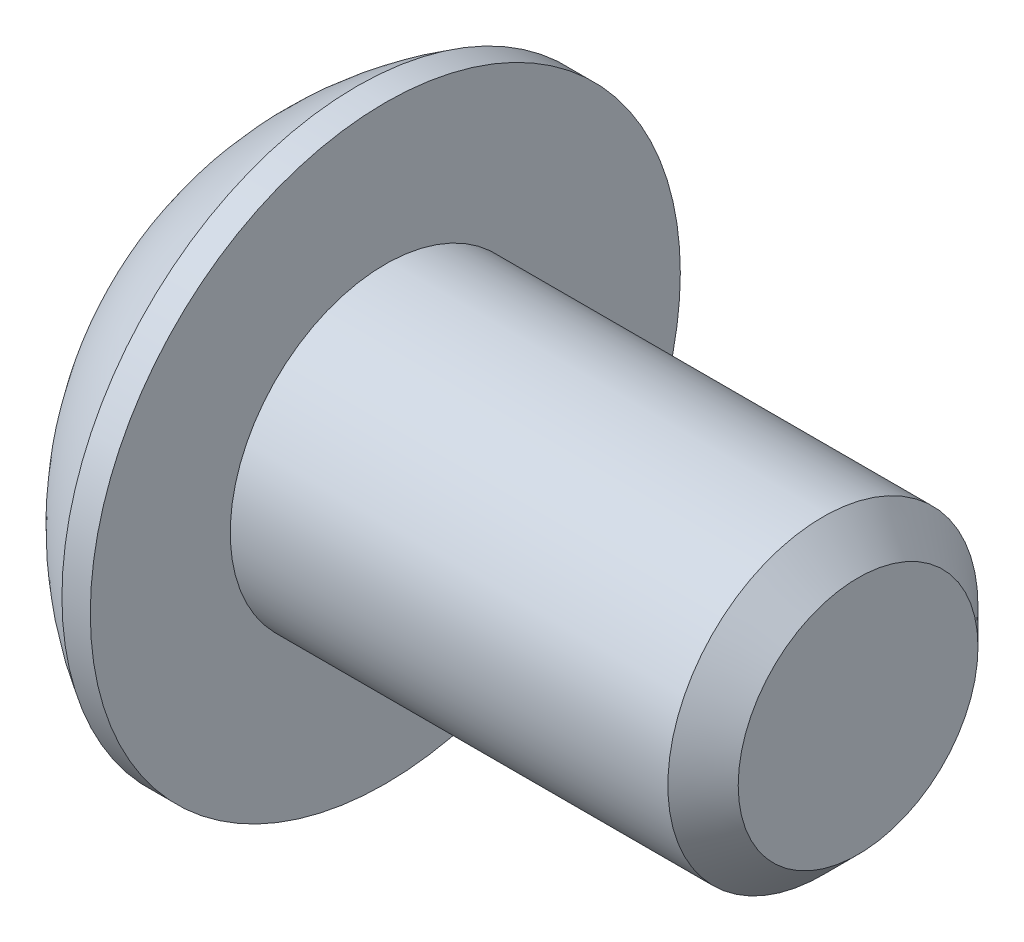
ISO-10303-21;
HEADER;
FILE_DESCRIPTION(('STEP AP214'),'2;1');
FILE_NAME('part.step','',(''),(''),'','','');
FILE_SCHEMA(('AUTOMOTIVE_DESIGN { 1 0 10303 214 1 1 1 1 }'));
ENDSEC;
DATA;
#1=APPLICATION_CONTEXT('core data for automotive mechanical design processes');
#2=APPLICATION_PROTOCOL_DEFINITION('international standard','automotive_design',2000,#1);
#3=PRODUCT_CONTEXT('',#1,'mechanical');
#4=PRODUCT('Part','Part','',(#3));
#5=PRODUCT_RELATED_PRODUCT_CATEGORY('part','',(#4));
#6=PRODUCT_DEFINITION_FORMATION('','',#4);
#7=PRODUCT_DEFINITION_CONTEXT('part definition',#1,'design');
#8=PRODUCT_DEFINITION('design','',#6,#7);
#9=PRODUCT_DEFINITION_SHAPE('','',#8);
#10=(LENGTH_UNIT() NAMED_UNIT(*) SI_UNIT(.MILLI.,.METRE.));
#11=(NAMED_UNIT(*) PLANE_ANGLE_UNIT() SI_UNIT($,.RADIAN.));
#12=(NAMED_UNIT(*) SI_UNIT($,.STERADIAN.) SOLID_ANGLE_UNIT());
#13=UNCERTAINTY_MEASURE_WITH_UNIT(LENGTH_MEASURE(1.E-05),#10,'distance_accuracy_value','');
#14=(GEOMETRIC_REPRESENTATION_CONTEXT(3) GLOBAL_UNCERTAINTY_ASSIGNED_CONTEXT((#13)) GLOBAL_UNIT_ASSIGNED_CONTEXT((#10,
#11,#12)) REPRESENTATION_CONTEXT('',''));
#15=CARTESIAN_POINT('',(0.,0.,0.));
#16=DIRECTION('',(0.,0.,1.));
#17=DIRECTION('',(1.,0.,0.));
#18=AXIS2_PLACEMENT_3D('',#15,#16,#17);
#19=CARTESIAN_POINT('',(4.2799,0.,0.));
#20=DIRECTION('',(1.,0.,0.));
#21=DIRECTION('',(0.,0.,-1.));
#22=AXIS2_PLACEMENT_3D('',#19,#20,#21);
#23=PLANE('',#22);
#24=CARTESIAN_POINT('',(4.2799,0.,0.));
#25=DIRECTION('',(1.,0.,0.));
#26=DIRECTION('',(0.,0.,-1.));
#27=AXIS2_PLACEMENT_3D('',#24,#25,#26);
#28=CIRCLE('',#27,1.6104);
#29=CARTESIAN_POINT('',(4.2799,0.,-1.6104));
#30=VERTEX_POINT('',#29);
#31=EDGE_CURVE('E40',#30,#30,#28,.T.);
#32=ORIENTED_EDGE('',*,*,#31,.T.);
#33=EDGE_LOOP('',(#32));
#34=FACE_BOUND('',#33,.T.);
#35=ADVANCED_FACE('F32',(#34),#23,.T.);
#36=CARTESIAN_POINT('',(4.2799,0.,0.));
#37=DIRECTION('',(1.,0.,0.));
#38=DIRECTION('',(0.,0.,-1.));
#39=AXIS2_PLACEMENT_3D('',#36,#37,#38);
#40=CYLINDRICAL_SURFACE('',#39,2.0828);
#41=CARTESIAN_POINT('',(3.8075,0.,0.));
#42=DIRECTION('',(1.,0.,0.));
#43=DIRECTION('',(0.,0.,-1.));
#44=AXIS2_PLACEMENT_3D('',#41,#42,#43);
#45=CIRCLE('',#44,2.0828);
#46=CARTESIAN_POINT('',(3.8075,0.,-2.0828));
#47=VERTEX_POINT('',#46);
#48=EDGE_CURVE('E11',#47,#47,#45,.F.);
#49=ORIENTED_EDGE('',*,*,#48,.T.);
#50=EDGE_LOOP('',(#49));
#51=FACE_BOUND('',#50,.T.);
#52=CARTESIAN_POINT('',(-2.0701,0.,0.));
#53=DIRECTION('',(1.,0.,0.));
#54=DIRECTION('',(0.,0.,-1.));
#55=AXIS2_PLACEMENT_3D('',#52,#53,#54);
#56=CIRCLE('',#55,2.0828);
#57=CARTESIAN_POINT('',(-2.0701,0.,-2.0828));
#58=VERTEX_POINT('',#57);
#59=EDGE_CURVE('E343',#58,#58,#56,.T.);
#60=ORIENTED_EDGE('',*,*,#59,.T.);
#61=EDGE_LOOP('',(#60));
#62=FACE_BOUND('',#61,.T.);
#63=ADVANCED_FACE('F400',(#51,#62),#40,.T.);
#64=CARTESIAN_POINT('',(-2.0701,2.0828,0.));
#65=DIRECTION('',(1.,0.,0.));
#66=DIRECTION('',(0.,0.,-1.));
#67=AXIS2_PLACEMENT_3D('',#64,#65,#66);
#68=PLANE('',#67);
#69=CARTESIAN_POINT('',(-2.0701,0.,0.));
#70=DIRECTION('',(1.,0.,0.));
#71=DIRECTION('',(0.,0.,-1.));
#72=AXIS2_PLACEMENT_3D('',#69,#70,#71);
#73=CIRCLE('',#72,3.9624);
#74=CARTESIAN_POINT('',(-2.0701,0.,-3.9624));
#75=VERTEX_POINT('',#74);
#76=EDGE_CURVE('E340',#75,#75,#73,.T.);
#77=ORIENTED_EDGE('',*,*,#76,.T.);
#78=EDGE_LOOP('',(#77));
#79=FACE_BOUND('',#78,.T.);
#80=ORIENTED_EDGE('',*,*,#59,.F.);
#81=EDGE_LOOP('',(#80));
#82=FACE_BOUND('',#81,.T.);
#83=ADVANCED_FACE('F396',(#79,#82),#68,.T.);
#84=CARTESIAN_POINT('',(4.2799,0.,0.));
#85=DIRECTION('',(1.,0.,0.));
#86=DIRECTION('',(0.,0.,-1.));
#87=AXIS2_PLACEMENT_3D('',#84,#85,#86);
#88=CYLINDRICAL_SURFACE('',#87,3.9624);
#89=CARTESIAN_POINT('',(-2.45110000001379,0.,0.));
#90=DIRECTION('',(1.,0.,0.));
#91=DIRECTION('',(0.,0.,-1.));
#92=AXIS2_PLACEMENT_3D('',#89,#90,#91);
#93=CIRCLE('',#92,3.9624);
#94=CARTESIAN_POINT('',(-2.45110000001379,0.,-3.9624));
#95=VERTEX_POINT('',#94);
#96=EDGE_CURVE('E337',#95,#95,#93,.T.);
#97=ORIENTED_EDGE('',*,*,#96,.T.);
#98=EDGE_LOOP('',(#97));
#99=FACE_BOUND('',#98,.T.);
#100=ORIENTED_EDGE('',*,*,#76,.F.);
#101=EDGE_LOOP('',(#100));
#102=FACE_BOUND('',#101,.T.);
#103=ADVANCED_FACE('F392',(#99,#102),#88,.T.);
#104=CARTESIAN_POINT('',(-0.146041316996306,0.,0.));
#105=DIRECTION('',(1.,0.,0.));
#106=DIRECTION('',(0.,0.,-1.));
#107=AXIS2_PLACEMENT_3D('',#104,#105,#106);
#108=DEGENERATE_TOROIDAL_SURFACE('',#107,8.01506428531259E-06,4.5841,.F.);
#109=CARTESIAN_POINT('',(-4.2799,0.,0.));
#110=DIRECTION('',(1.,0.,0.));
#111=DIRECTION('',(0.,0.,-1.));
#112=AXIS2_PLACEMENT_3D('',#109,#110,#111);
#113=CIRCLE('',#112,1.9812);
#114=CARTESIAN_POINT('',(-4.2799,0.,-1.9812));
#115=VERTEX_POINT('',#114);
#116=EDGE_CURVE('E320',#115,#115,#113,.T.);
#117=ORIENTED_EDGE('',*,*,#116,.T.);
#118=EDGE_LOOP('',(#117));
#119=FACE_BOUND('',#118,.T.);
#120=ORIENTED_EDGE('',*,*,#96,.F.);
#121=EDGE_LOOP('',(#120));
#122=FACE_BOUND('',#121,.T.);
#123=ADVANCED_FACE('F388',(#119,#122),#108,.F.);
#124=CARTESIAN_POINT('',(-4.2799,1.9812,0.));
#125=DIRECTION('',(-1.,0.,0.));
#126=DIRECTION('',(0.,0.,1.));
#127=AXIS2_PLACEMENT_3D('',#124,#125,#126);
#128=PLANE('',#127);
#129=CARTESIAN_POINT('',(-4.2799,0.,0.));
#130=DIRECTION('',(-1.,0.,0.));
#131=DIRECTION('',(0.,0.,1.));
#132=AXIS2_PLACEMENT_3D('',#129,#130,#131);
#133=CIRCLE('',#132,1.194);
#134=CARTESIAN_POINT('',(-4.2799,1.02293455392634,0.6158253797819));
#135=VERTEX_POINT('',#134);
#136=CARTESIAN_POINT('',(-4.2799,1.04478770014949,0.577974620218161));
#137=VERTEX_POINT('',#136);
#138=EDGE_CURVE('E169',#135,#137,#133,.T.);
#139=ORIENTED_EDGE('',*,*,#138,.F.);
#140=DIRECTION('',(0.,0.5,-0.866025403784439));
#141=VECTOR('',#140,1.);
#142=CARTESIAN_POINT('',(-4.2799,1.37848150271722,0.));
#143=LINE('',#142,#141);
#144=CARTESIAN_POINT('',(-4.2799,0.689240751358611,1.19380000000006));
#145=VERTEX_POINT('',#144);
#146=EDGE_CURVE('E313',#145,#135,#143,.T.);
#147=ORIENTED_EDGE('',*,*,#146,.F.);
#148=DIRECTION('',(0.,1.,0.));
#149=VECTOR('',#148,1.);
#150=CARTESIAN_POINT('',(-4.2799,0.689240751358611,1.19380000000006));
#151=LINE('',#150,#149);
#152=CARTESIAN_POINT('',(-4.2799,0.0218531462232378,1.19380000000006));
#153=VERTEX_POINT('',#152);
#154=EDGE_CURVE('E308',#153,#145,#151,.T.);
#155=ORIENTED_EDGE('',*,*,#154,.F.);
#156=CARTESIAN_POINT('',(-4.2799,-0.02185314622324,1.19380000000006));
#157=VERTEX_POINT('',#156);
#158=EDGE_CURVE('E175',#157,#153,#133,.T.);
#159=ORIENTED_EDGE('',*,*,#158,.F.);
#160=CARTESIAN_POINT('',(-4.2799,-0.68924075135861,1.19380000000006));
#161=VERTEX_POINT('',#160);
#162=EDGE_CURVE('E309',#161,#157,#151,.T.);
#163=ORIENTED_EDGE('',*,*,#162,.F.);
#164=DIRECTION('',(0.,0.5,0.866025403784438));
#165=VECTOR('',#164,1.);
#166=CARTESIAN_POINT('',(-4.2799,-0.68924075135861,1.19380000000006));
#167=LINE('',#166,#165);
#168=CARTESIAN_POINT('',(-4.2799,-1.02293455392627,0.615825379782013));
#169=VERTEX_POINT('',#168);
#170=EDGE_CURVE('E304',#169,#161,#167,.T.);
#171=ORIENTED_EDGE('',*,*,#170,.F.);
#172=CARTESIAN_POINT('',(-4.2799,-1.04478770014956,0.577974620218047));
#173=VERTEX_POINT('',#172);
#174=EDGE_CURVE('E427',#173,#169,#133,.T.);
#175=ORIENTED_EDGE('',*,*,#174,.F.);
#176=CARTESIAN_POINT('',(-4.2799,-1.37848150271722,0.));
#177=VERTEX_POINT('',#176);
#178=EDGE_CURVE('E305',#177,#173,#167,.T.);
#179=ORIENTED_EDGE('',*,*,#178,.F.);
#180=DIRECTION('',(0.,-0.5,0.866025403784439));
#181=VECTOR('',#180,1.);
#182=CARTESIAN_POINT('',(-4.2799,-1.37848150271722,0.));
#183=LINE('',#182,#181);
#184=CARTESIAN_POINT('',(-4.2799,-1.04478770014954,-0.577974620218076));
#185=VERTEX_POINT('',#184);
#186=EDGE_CURVE('E300',#185,#177,#183,.T.);
#187=ORIENTED_EDGE('',*,*,#186,.F.);
#188=CARTESIAN_POINT('',(-4.2799,-1.02293455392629,-0.615825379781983));
#189=VERTEX_POINT('',#188);
#190=EDGE_CURVE('E426',#189,#185,#133,.T.);
#191=ORIENTED_EDGE('',*,*,#190,.F.);
#192=CARTESIAN_POINT('',(-4.2799,-0.689240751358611,-1.19380000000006));
#193=VERTEX_POINT('',#192);
#194=EDGE_CURVE('E301',#193,#189,#183,.T.);
#195=ORIENTED_EDGE('',*,*,#194,.F.);
#196=DIRECTION('',(0.,-1.,0.));
#197=VECTOR('',#196,1.);
#198=CARTESIAN_POINT('',(-4.2799,-0.689240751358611,-1.19380000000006));
#199=LINE('',#198,#197);
#200=CARTESIAN_POINT('',(-4.2799,-0.02185314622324,-1.19380000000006));
#201=VERTEX_POINT('',#200);
#202=EDGE_CURVE('E292',#201,#193,#199,.T.);
#203=ORIENTED_EDGE('',*,*,#202,.F.);
#204=CARTESIAN_POINT('',(-4.2799,0.0218531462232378,-1.19380000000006));
#205=VERTEX_POINT('',#204);
#206=EDGE_CURVE('E422',#205,#201,#133,.T.);
#207=ORIENTED_EDGE('',*,*,#206,.F.);
#208=CARTESIAN_POINT('',(-4.2799,0.689240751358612,-1.19380000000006));
#209=VERTEX_POINT('',#208);
#210=EDGE_CURVE('E297',#209,#205,#199,.T.);
#211=ORIENTED_EDGE('',*,*,#210,.F.);
#212=DIRECTION('',(0.,-0.499999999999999,-0.866025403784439));
#213=VECTOR('',#212,1.);
#214=CARTESIAN_POINT('',(-4.2799,0.689240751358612,-1.19380000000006));
#215=LINE('',#214,#213);
#216=CARTESIAN_POINT('',(-4.2799,1.02293455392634,-0.615825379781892));
#217=VERTEX_POINT('',#216);
#218=EDGE_CURVE('E285',#217,#209,#215,.T.);
#219=ORIENTED_EDGE('',*,*,#218,.F.);
#220=CARTESIAN_POINT('',(-4.2799,1.04478770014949,-0.577974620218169));
#221=VERTEX_POINT('',#220);
#222=EDGE_CURVE('E173',#221,#217,#133,.T.);
#223=ORIENTED_EDGE('',*,*,#222,.F.);
#224=CARTESIAN_POINT('',(-4.2799,1.37848150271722,0.));
#225=VERTEX_POINT('',#224);
#226=EDGE_CURVE('E288',#225,#221,#215,.T.);
#227=ORIENTED_EDGE('',*,*,#226,.F.);
#228=EDGE_CURVE('E312',#137,#225,#143,.T.);
#229=ORIENTED_EDGE('',*,*,#228,.F.);
#230=EDGE_LOOP('',(#139,#147,#155,#159,#163,#171,#175,#179,#187,#191,#195,#203,#207,#211,#219,
#223,#227,#229));
#231=FACE_BOUND('',#230,.T.);
#232=ORIENTED_EDGE('',*,*,#116,.F.);
#233=EDGE_LOOP('',(#232));
#234=FACE_BOUND('',#233,.T.);
#235=ADVANCED_FACE('F385',(#231,#234),#128,.T.);
#236=CARTESIAN_POINT('',(-2.9591,0.689240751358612,-1.19380000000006));
#237=DIRECTION('',(0.,0.866025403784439,-0.5));
#238=DIRECTION('',(0.,0.5,0.866025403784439));
#239=AXIS2_PLACEMENT_3D('',#236,#237,#238);
#240=PLANE('',#239);
#241=CARTESIAN_POINT('',(-2.9599,1.04478770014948,-0.577974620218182));
#242=DIRECTION('',(0.,-0.499999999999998,-0.86602540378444));
#243=VECTOR('',#242,1.);
#244=LINE('',#241,#243);
#245=CARTESIAN_POINT('',(-2.9599,1.04478770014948,-0.577974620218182));
#246=VERTEX_POINT('',#245);
#247=CARTESIAN_POINT('',(-2.9599,1.02293455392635,-0.615825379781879));
#248=VERTEX_POINT('',#247);
#249=EDGE_CURVE('E470',#246,#248,#244,.T.);
#250=ORIENTED_EDGE('',*,*,#249,.T.);
#251=DIRECTION('',(-1.,0.,0.));
#252=VECTOR('',#251,1.);
#253=CARTESIAN_POINT('',(-4.2799,1.02293455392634,-0.615825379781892));
#254=LINE('',#253,#252);
#255=EDGE_CURVE('E55',#248,#217,#254,.T.);
#256=ORIENTED_EDGE('',*,*,#255,.T.);
#257=ORIENTED_EDGE('',*,*,#218,.T.);
#258=DIRECTION('',(-1.,0.,0.));
#259=VECTOR('',#258,1.);
#260=CARTESIAN_POINT('',(-2.9591,0.689240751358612,-1.19380000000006));
#261=LINE('',#260,#259);
#262=CARTESIAN_POINT('',(-2.9591,0.689240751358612,-1.19380000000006));
#263=VERTEX_POINT('',#262);
#264=EDGE_CURVE('E333',#263,#209,#261,.T.);
#265=ORIENTED_EDGE('',*,*,#264,.F.);
#266=DIRECTION('',(0.,-0.499999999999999,-0.866025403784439));
#267=VECTOR('',#266,1.);
#268=CARTESIAN_POINT('',(-2.9591,0.689240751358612,-1.19380000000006));
#269=LINE('',#268,#267);
#270=CARTESIAN_POINT('',(-2.9591,1.37848150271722,0.));
#271=VERTEX_POINT('',#270);
#272=EDGE_CURVE('E316',#271,#263,#269,.T.);
#273=ORIENTED_EDGE('',*,*,#272,.F.);
#274=DIRECTION('',(-1.,0.,0.));
#275=VECTOR('',#274,1.);
#276=CARTESIAN_POINT('',(-2.9591,1.37848150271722,0.));
#277=LINE('',#276,#275);
#278=EDGE_CURVE('E317',#271,#225,#277,.T.);
#279=ORIENTED_EDGE('',*,*,#278,.T.);
#280=ORIENTED_EDGE('',*,*,#226,.T.);
#281=DIRECTION('',(-1.,0.,0.));
#282=VECTOR('',#281,1.);
#283=CARTESIAN_POINT('',(-4.2799,1.04478770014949,-0.577974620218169));
#284=LINE('',#283,#282);
#285=EDGE_CURVE('E283',#221,#246,#284,.F.);
#286=ORIENTED_EDGE('',*,*,#285,.T.);
#287=EDGE_LOOP('',(#250,#256,#257,#265,#273,#279,#280,#286));
#288=FACE_BOUND('',#287,.T.);
#289=ADVANCED_FACE('F260',(#288),#240,.F.);
#290=CARTESIAN_POINT('',(-2.9591,1.37848150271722,0.));
#291=DIRECTION('',(0.,0.866025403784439,0.5));
#292=DIRECTION('',(0.,-0.5,0.866025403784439));
#293=AXIS2_PLACEMENT_3D('',#290,#291,#292);
#294=PLANE('',#293);
#295=CARTESIAN_POINT('',(-2.9599,1.02293455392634,0.6158253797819));
#296=DIRECTION('',(0.,0.500000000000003,-0.866025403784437));
#297=VECTOR('',#296,1.);
#298=LINE('',#295,#297);
#299=CARTESIAN_POINT('',(-2.9599,1.02293455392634,0.6158253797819));
#300=VERTEX_POINT('',#299);
#301=CARTESIAN_POINT('',(-2.9599,1.04478770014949,0.577974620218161));
#302=VERTEX_POINT('',#301);
#303=EDGE_CURVE('E247',#300,#302,#298,.T.);
#304=ORIENTED_EDGE('',*,*,#303,.T.);
#305=DIRECTION('',(-1.,0.,0.));
#306=VECTOR('',#305,1.);
#307=CARTESIAN_POINT('',(-4.2799,1.04478770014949,0.577974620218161));
#308=LINE('',#307,#306);
#309=EDGE_CURVE('E47',#302,#137,#308,.T.);
#310=ORIENTED_EDGE('',*,*,#309,.T.);
#311=ORIENTED_EDGE('',*,*,#228,.T.);
#312=ORIENTED_EDGE('',*,*,#278,.F.);
#313=DIRECTION('',(0.,0.5,-0.866025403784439));
#314=VECTOR('',#313,1.);
#315=CARTESIAN_POINT('',(-2.9591,1.37848150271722,0.));
#316=LINE('',#315,#314);
#317=CARTESIAN_POINT('',(-2.9591,0.689240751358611,1.19380000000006));
#318=VERTEX_POINT('',#317);
#319=EDGE_CURVE('E295',#318,#271,#316,.T.);
#320=ORIENTED_EDGE('',*,*,#319,.F.);
#321=DIRECTION('',(-1.,0.,0.));
#322=VECTOR('',#321,1.);
#323=CARTESIAN_POINT('',(-2.9591,0.689240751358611,1.19380000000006));
#324=LINE('',#323,#322);
#325=EDGE_CURVE('E321',#318,#145,#324,.T.);
#326=ORIENTED_EDGE('',*,*,#325,.T.);
#327=ORIENTED_EDGE('',*,*,#146,.T.);
#328=DIRECTION('',(-1.,0.,0.));
#329=VECTOR('',#328,1.);
#330=CARTESIAN_POINT('',(-4.2799,1.02293455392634,0.6158253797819));
#331=LINE('',#330,#329);
#332=EDGE_CURVE('E225',#135,#300,#331,.F.);
#333=ORIENTED_EDGE('',*,*,#332,.T.);
#334=EDGE_LOOP('',(#304,#310,#311,#312,#320,#326,#327,#333));
#335=FACE_BOUND('',#334,.T.);
#336=ADVANCED_FACE('F250',(#335),#294,.F.);
#337=CARTESIAN_POINT('',(-2.9591,0.689240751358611,1.19380000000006));
#338=DIRECTION('',(0.,0.,1.));
#339=DIRECTION('',(1.,0.,0.));
#340=AXIS2_PLACEMENT_3D('',#337,#338,#339);
#341=PLANE('',#340);
#342=CARTESIAN_POINT('',(-2.9599,-0.0218531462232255,1.19380000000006));
#343=DIRECTION('',(0.,1.,0.));
#344=VECTOR('',#343,1.);
#345=LINE('',#342,#344);
#346=CARTESIAN_POINT('',(-2.9599,-0.0218531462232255,1.19380000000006));
#347=VERTEX_POINT('',#346);
#348=CARTESIAN_POINT('',(-2.95989999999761,0.0218531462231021,1.19380000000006));
#349=VERTEX_POINT('',#348);
#350=EDGE_CURVE('E440',#347,#349,#345,.T.);
#351=ORIENTED_EDGE('',*,*,#350,.T.);
#352=DIRECTION('',(-1.,0.,0.));
#353=VECTOR('',#352,1.);
#354=CARTESIAN_POINT('',(-4.2799,0.0218531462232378,1.19380000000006));
#355=LINE('',#354,#353);
#356=EDGE_CURVE('E234',#349,#153,#355,.T.);
#357=ORIENTED_EDGE('',*,*,#356,.T.);
#358=ORIENTED_EDGE('',*,*,#154,.T.);
#359=ORIENTED_EDGE('',*,*,#325,.F.);
#360=DIRECTION('',(0.,1.,0.));
#361=VECTOR('',#360,1.);
#362=CARTESIAN_POINT('',(-2.9591,0.689240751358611,1.19380000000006));
#363=LINE('',#362,#361);
#364=CARTESIAN_POINT('',(-2.9591,-0.68924075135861,1.19380000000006));
#365=VERTEX_POINT('',#364);
#366=EDGE_CURVE('E448',#365,#318,#363,.T.);
#367=ORIENTED_EDGE('',*,*,#366,.F.);
#368=DIRECTION('',(-1.,0.,0.));
#369=VECTOR('',#368,1.);
#370=CARTESIAN_POINT('',(-2.9591,-0.68924075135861,1.19380000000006));
#371=LINE('',#370,#369);
#372=EDGE_CURVE('E324',#365,#161,#371,.T.);
#373=ORIENTED_EDGE('',*,*,#372,.T.);
#374=ORIENTED_EDGE('',*,*,#162,.T.);
#375=DIRECTION('',(-1.,0.,0.));
#376=VECTOR('',#375,1.);
#377=CARTESIAN_POINT('',(-4.2799,-0.02185314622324,1.19380000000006));
#378=LINE('',#377,#376);
#379=EDGE_CURVE('E437',#157,#347,#378,.F.);
#380=ORIENTED_EDGE('',*,*,#379,.T.);
#381=EDGE_LOOP('',(#351,#357,#358,#359,#367,#373,#374,#380));
#382=FACE_BOUND('',#381,.T.);
#383=ADVANCED_FACE('F259',(#382),#341,.F.);
#384=CARTESIAN_POINT('',(-2.9591,-0.68924075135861,1.19380000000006));
#385=DIRECTION('',(0.,-0.866025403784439,0.5));
#386=DIRECTION('',(0.,-0.5,-0.866025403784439));
#387=AXIS2_PLACEMENT_3D('',#384,#385,#386);
#388=PLANE('',#387);
#389=CARTESIAN_POINT('',(-2.9599,-1.04478770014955,0.57797462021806));
#390=DIRECTION('',(0.,0.500000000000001,0.866025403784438));
#391=VECTOR('',#390,1.);
#392=LINE('',#389,#391);
#393=CARTESIAN_POINT('',(-2.9599,-1.04478770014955,0.57797462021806));
#394=VERTEX_POINT('',#393);
#395=CARTESIAN_POINT('',(-2.9599,-1.02293455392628,0.615825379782));
#396=VERTEX_POINT('',#395);
#397=EDGE_CURVE('E172',#394,#396,#392,.T.);
#398=ORIENTED_EDGE('',*,*,#397,.T.);
#399=DIRECTION('',(-1.,0.,0.));
#400=VECTOR('',#399,1.);
#401=CARTESIAN_POINT('',(-4.2799,-1.02293455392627,0.615825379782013));
#402=LINE('',#401,#400);
#403=EDGE_CURVE('E472',#396,#169,#402,.T.);
#404=ORIENTED_EDGE('',*,*,#403,.T.);
#405=ORIENTED_EDGE('',*,*,#170,.T.);
#406=ORIENTED_EDGE('',*,*,#372,.F.);
#407=DIRECTION('',(0.,0.5,0.866025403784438));
#408=VECTOR('',#407,1.);
#409=CARTESIAN_POINT('',(-2.9591,-0.68924075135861,1.19380000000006));
#410=LINE('',#409,#408);
#411=CARTESIAN_POINT('',(-2.9591,-1.37848150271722,0.));
#412=VERTEX_POINT('',#411);
#413=EDGE_CURVE('E454',#412,#365,#410,.T.);
#414=ORIENTED_EDGE('',*,*,#413,.F.);
#415=DIRECTION('',(-1.,0.,0.));
#416=VECTOR('',#415,1.);
#417=CARTESIAN_POINT('',(-2.9591,-1.37848150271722,0.));
#418=LINE('',#417,#416);
#419=EDGE_CURVE('E327',#412,#177,#418,.T.);
#420=ORIENTED_EDGE('',*,*,#419,.T.);
#421=ORIENTED_EDGE('',*,*,#178,.T.);
#422=DIRECTION('',(-1.,0.,0.));
#423=VECTOR('',#422,1.);
#424=CARTESIAN_POINT('',(-4.2799,-1.04478770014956,0.577974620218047));
#425=LINE('',#424,#423);
#426=EDGE_CURVE('E469',#173,#394,#425,.F.);
#427=ORIENTED_EDGE('',*,*,#426,.T.);
#428=EDGE_LOOP('',(#398,#404,#405,#406,#414,#420,#421,#427));
#429=FACE_BOUND('',#428,.T.);
#430=ADVANCED_FACE('F264',(#429),#388,.F.);
#431=CARTESIAN_POINT('',(-2.9591,-1.37848150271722,0.));
#432=DIRECTION('',(0.,-0.866025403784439,-0.5));
#433=DIRECTION('',(0.,0.5,-0.866025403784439));
#434=AXIS2_PLACEMENT_3D('',#431,#432,#433);
#435=PLANE('',#434);
#436=CARTESIAN_POINT('',(-2.9599,-1.02293455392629,-0.615825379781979));
#437=DIRECTION('',(0.,-0.499999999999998,0.86602540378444));
#438=VECTOR('',#437,1.);
#439=LINE('',#436,#438);
#440=CARTESIAN_POINT('',(-2.9599,-1.02293455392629,-0.615825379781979));
#441=VERTEX_POINT('',#440);
#442=CARTESIAN_POINT('',(-2.9599,-1.04478770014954,-0.577974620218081));
#443=VERTEX_POINT('',#442);
#444=EDGE_CURVE('E168',#441,#443,#439,.T.);
#445=ORIENTED_EDGE('',*,*,#444,.T.);
#446=DIRECTION('',(-1.,0.,0.));
#447=VECTOR('',#446,1.);
#448=CARTESIAN_POINT('',(-4.2799,-1.04478770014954,-0.577974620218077));
#449=LINE('',#448,#447);
#450=EDGE_CURVE('E411',#443,#185,#449,.T.);
#451=ORIENTED_EDGE('',*,*,#450,.T.);
#452=ORIENTED_EDGE('',*,*,#186,.T.);
#453=ORIENTED_EDGE('',*,*,#419,.F.);
#454=DIRECTION('',(0.,-0.5,0.866025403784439));
#455=VECTOR('',#454,1.);
#456=CARTESIAN_POINT('',(-2.9591,-1.37848150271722,0.));
#457=LINE('',#456,#455);
#458=CARTESIAN_POINT('',(-2.9591,-0.689240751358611,-1.19380000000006));
#459=VERTEX_POINT('',#458);
#460=EDGE_CURVE('E455',#459,#412,#457,.T.);
#461=ORIENTED_EDGE('',*,*,#460,.F.);
#462=DIRECTION('',(-1.,0.,0.));
#463=VECTOR('',#462,1.);
#464=CARTESIAN_POINT('',(-2.9591,-0.689240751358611,-1.19380000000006));
#465=LINE('',#464,#463);
#466=EDGE_CURVE('E330',#459,#193,#465,.T.);
#467=ORIENTED_EDGE('',*,*,#466,.T.);
#468=ORIENTED_EDGE('',*,*,#194,.T.);
#469=DIRECTION('',(-1.,0.,0.));
#470=VECTOR('',#469,1.);
#471=CARTESIAN_POINT('',(-4.2799,-1.02293455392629,-0.615825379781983));
#472=LINE('',#471,#470);
#473=EDGE_CURVE('E361',#189,#441,#472,.F.);
#474=ORIENTED_EDGE('',*,*,#473,.T.);
#475=EDGE_LOOP('',(#445,#451,#452,#453,#461,#467,#468,#474));
#476=FACE_BOUND('',#475,.T.);
#477=ADVANCED_FACE('F370',(#476),#435,.F.);
#478=CARTESIAN_POINT('',(-2.9591,-0.689240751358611,-1.19380000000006));
#479=DIRECTION('',(0.,0.,-1.));
#480=DIRECTION('',(-1.,0.,0.));
#481=AXIS2_PLACEMENT_3D('',#478,#479,#480);
#482=PLANE('',#481);
#483=CARTESIAN_POINT('',(-2.9599,0.0218531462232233,-1.19380000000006));
#484=DIRECTION('',(0.,-1.,0.));
#485=VECTOR('',#484,1.);
#486=LINE('',#483,#485);
#487=CARTESIAN_POINT('',(-2.9599,0.0218531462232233,-1.19380000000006));
#488=VERTEX_POINT('',#487);
#489=CARTESIAN_POINT('',(-2.9598999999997,-0.0218531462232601,-1.19380000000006));
#490=VERTEX_POINT('',#489);
#491=EDGE_CURVE('E180',#488,#490,#486,.T.);
#492=ORIENTED_EDGE('',*,*,#491,.T.);
#493=DIRECTION('',(-1.,0.,0.));
#494=VECTOR('',#493,1.);
#495=CARTESIAN_POINT('',(-4.2799,-0.02185314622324,-1.19380000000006));
#496=LINE('',#495,#494);
#497=EDGE_CURVE('E354',#490,#201,#496,.T.);
#498=ORIENTED_EDGE('',*,*,#497,.T.);
#499=ORIENTED_EDGE('',*,*,#202,.T.);
#500=ORIENTED_EDGE('',*,*,#466,.F.);
#501=DIRECTION('',(0.,-1.,0.));
#502=VECTOR('',#501,1.);
#503=CARTESIAN_POINT('',(-2.9591,-0.689240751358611,-1.19380000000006));
#504=LINE('',#503,#502);
#505=EDGE_CURVE('E459',#263,#459,#504,.T.);
#506=ORIENTED_EDGE('',*,*,#505,.F.);
#507=ORIENTED_EDGE('',*,*,#264,.T.);
#508=ORIENTED_EDGE('',*,*,#210,.T.);
#509=DIRECTION('',(-1.,0.,0.));
#510=VECTOR('',#509,1.);
#511=CARTESIAN_POINT('',(-4.2799,0.0218531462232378,-1.19380000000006));
#512=LINE('',#511,#510);
#513=EDGE_CURVE('E351',#205,#488,#512,.F.);
#514=ORIENTED_EDGE('',*,*,#513,.T.);
#515=EDGE_LOOP('',(#492,#498,#499,#500,#506,#507,#508,#514));
#516=FACE_BOUND('',#515,.T.);
#517=ADVANCED_FACE('F378',(#516),#482,.F.);
#518=CARTESIAN_POINT('',(-2.9591,2.06772225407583,1.19380000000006));
#519=DIRECTION('',(1.,0.,0.));
#520=DIRECTION('',(0.,0.,-1.));
#521=AXIS2_PLACEMENT_3D('',#518,#519,#520);
#522=PLANE('',#521);
#523=CARTESIAN_POINT('',(-2.9591,0.,0.));
#524=DIRECTION('',(1.,0.,0.));
#525=DIRECTION('',(0.,0.,-1.));
#526=AXIS2_PLACEMENT_3D('',#523,#524,#525);
#527=CIRCLE('',#526,1.19261435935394);
#528=CARTESIAN_POINT('',(-2.9591,0.,-1.19261435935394));
#529=VERTEX_POINT('',#528);
#530=EDGE_CURVE('E166',#529,#529,#527,.T.);
#531=ORIENTED_EDGE('',*,*,#530,.T.);
#532=EDGE_LOOP('',(#531));
#533=FACE_BOUND('',#532,.T.);
#534=ORIENTED_EDGE('',*,*,#272,.T.);
#535=ORIENTED_EDGE('',*,*,#505,.T.);
#536=ORIENTED_EDGE('',*,*,#460,.T.);
#537=ORIENTED_EDGE('',*,*,#413,.T.);
#538=ORIENTED_EDGE('',*,*,#366,.T.);
#539=ORIENTED_EDGE('',*,*,#319,.T.);
#540=EDGE_LOOP('',(#534,#535,#536,#537,#538,#539));
#541=FACE_BOUND('',#540,.T.);
#542=ADVANCED_FACE('F198',(#533,#541),#522,.F.);
#543=CARTESIAN_POINT('',(-4.2799,0.,0.));
#544=DIRECTION('',(-1.,0.,0.));
#545=DIRECTION('',(0.,0.,1.));
#546=AXIS2_PLACEMENT_3D('',#543,#544,#545);
#547=CYLINDRICAL_SURFACE('',#546,1.194);
#548=ORIENTED_EDGE('',*,*,#491,.F.);
#549=ORIENTED_EDGE('',*,*,#513,.F.);
#550=ORIENTED_EDGE('',*,*,#206,.T.);
#551=ORIENTED_EDGE('',*,*,#497,.F.);
#552=EDGE_LOOP('',(#548,#549,#550,#551));
#553=FACE_BOUND('',#552,.T.);
#554=ADVANCED_FACE('F162',(#553),#547,.F.);
#555=CARTESIAN_POINT('',(-2.9599,0.,0.));
#556=DIRECTION('',(-1.,0.,0.));
#557=DIRECTION('',(0.,0.,1.));
#558=AXIS2_PLACEMENT_3D('',#555,#556,#557);
#559=CONICAL_SURFACE('',#558,1.194,1.0471975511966);
#560=CARTESIAN_POINT('',(-2.27054377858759,0.,0.));
#561=VERTEX_POINT('',#560);
#562=VERTEX_LOOP('',#561);
#563=FACE_BOUND('',#562,.T.);
#564=ORIENTED_EDGE('',*,*,#530,.F.);
#565=EDGE_LOOP('',(#564));
#566=FACE_BOUND('',#565,.T.);
#567=ADVANCED_FACE('F158',(#563,#566),#559,.F.);
#568=ORIENTED_EDGE('',*,*,#444,.F.);
#569=ORIENTED_EDGE('',*,*,#473,.F.);
#570=ORIENTED_EDGE('',*,*,#190,.T.);
#571=ORIENTED_EDGE('',*,*,#450,.F.);
#572=EDGE_LOOP('',(#568,#569,#570,#571));
#573=FACE_BOUND('',#572,.T.);
#574=ADVANCED_FACE('F161',(#573),#547,.F.);
#575=ORIENTED_EDGE('',*,*,#397,.F.);
#576=ORIENTED_EDGE('',*,*,#426,.F.);
#577=ORIENTED_EDGE('',*,*,#174,.T.);
#578=ORIENTED_EDGE('',*,*,#403,.F.);
#579=EDGE_LOOP('',(#575,#576,#577,#578));
#580=FACE_BOUND('',#579,.T.);
#581=ADVANCED_FACE('F493',(#580),#547,.F.);
#582=ORIENTED_EDGE('',*,*,#350,.F.);
#583=ORIENTED_EDGE('',*,*,#379,.F.);
#584=ORIENTED_EDGE('',*,*,#158,.T.);
#585=ORIENTED_EDGE('',*,*,#356,.F.);
#586=EDGE_LOOP('',(#582,#583,#584,#585));
#587=FACE_BOUND('',#586,.T.);
#588=ADVANCED_FACE('F197',(#587),#547,.F.);
#589=ORIENTED_EDGE('',*,*,#249,.F.);
#590=ORIENTED_EDGE('',*,*,#285,.F.);
#591=ORIENTED_EDGE('',*,*,#222,.T.);
#592=ORIENTED_EDGE('',*,*,#255,.F.);
#593=EDGE_LOOP('',(#589,#590,#591,#592));
#594=FACE_BOUND('',#593,.T.);
#595=ADVANCED_FACE('F187',(#594),#547,.F.);
#596=ORIENTED_EDGE('',*,*,#303,.F.);
#597=ORIENTED_EDGE('',*,*,#332,.F.);
#598=ORIENTED_EDGE('',*,*,#138,.T.);
#599=ORIENTED_EDGE('',*,*,#309,.F.);
#600=EDGE_LOOP('',(#596,#597,#598,#599));
#601=FACE_BOUND('',#600,.T.);
#602=ADVANCED_FACE('F196',(#601),#547,.F.);
#603=CARTESIAN_POINT('',(4.2799,0.,0.));
#604=DIRECTION('',(-1.,0.,0.));
#605=DIRECTION('',(0.,0.,1.));
#606=AXIS2_PLACEMENT_3D('',#603,#604,#605);
#607=CONICAL_SURFACE('',#606,1.6104,0.785398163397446);
#608=ORIENTED_EDGE('',*,*,#48,.F.);
#609=EDGE_LOOP('',(#608));
#610=FACE_BOUND('',#609,.T.);
#611=ORIENTED_EDGE('',*,*,#31,.F.);
#612=EDGE_LOOP('',(#611));
#613=FACE_BOUND('',#612,.T.);
#614=ADVANCED_FACE('F34',(#610,#613),#607,.T.);
#615=CLOSED_SHELL('',(#35,#63,#83,#103,#123,#235,#289,#336,#383,#430,#477,#517,#542,#554,#567,
#574,#581,#588,#595,#602,#614));
#616=MANIFOLD_SOLID_BREP('B2',#615);
#617=ADVANCED_BREP_SHAPE_REPRESENTATION('',(#18,#616),#14);
#618=SHAPE_DEFINITION_REPRESENTATION(#9,#617);
ENDSEC;
END-ISO-10303-21;
